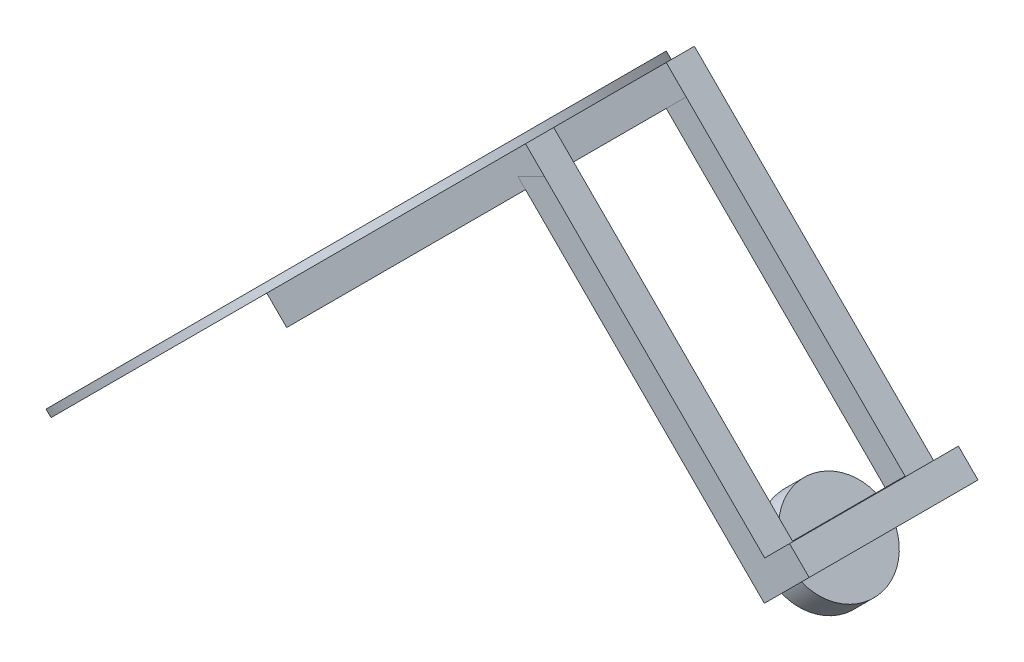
ISO-10303-21;
HEADER;
FILE_DESCRIPTION(('STEP AP214'),'2;1');
FILE_NAME('part.step','',(''),(''),'','','');
FILE_SCHEMA(('AUTOMOTIVE_DESIGN { 1 0 10303 214 1 1 1 1 }'));
ENDSEC;
DATA;
#1=APPLICATION_CONTEXT('core data for automotive mechanical design processes');
#2=APPLICATION_PROTOCOL_DEFINITION('international standard','automotive_design',2000,#1);
#3=PRODUCT_CONTEXT('',#1,'mechanical');
#4=PRODUCT('Part','Part','',(#3));
#5=PRODUCT_RELATED_PRODUCT_CATEGORY('part','',(#4));
#6=PRODUCT_DEFINITION_FORMATION('','',#4);
#7=PRODUCT_DEFINITION_CONTEXT('part definition',#1,'design');
#8=PRODUCT_DEFINITION('design','',#6,#7);
#9=PRODUCT_DEFINITION_SHAPE('','',#8);
#10=(LENGTH_UNIT() NAMED_UNIT(*) SI_UNIT(.MILLI.,.METRE.));
#11=(NAMED_UNIT(*) PLANE_ANGLE_UNIT() SI_UNIT($,.RADIAN.));
#12=(NAMED_UNIT(*) SI_UNIT($,.STERADIAN.) SOLID_ANGLE_UNIT());
#13=UNCERTAINTY_MEASURE_WITH_UNIT(LENGTH_MEASURE(1.E-05),#10,'distance_accuracy_value','');
#14=(GEOMETRIC_REPRESENTATION_CONTEXT(3) GLOBAL_UNCERTAINTY_ASSIGNED_CONTEXT((#13)) GLOBAL_UNIT_ASSIGNED_CONTEXT((#10,
#11,#12)) REPRESENTATION_CONTEXT('',''));
#15=CARTESIAN_POINT('',(0.,0.,0.));
#16=DIRECTION('',(0.,0.,1.));
#17=DIRECTION('',(1.,0.,0.));
#18=AXIS2_PLACEMENT_3D('',#15,#16,#17);
#19=CARTESIAN_POINT('',(228.226146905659,-233.486659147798,12.7));
#20=DIRECTION('',(0.707106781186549,0.707106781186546,0.));
#21=DIRECTION('',(0.,0.,1.));
#22=AXIS2_PLACEMENT_3D('',#19,#20,#21);
#23=PLANE('',#22);
#24=CARTESIAN_POINT('',(219.381229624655,-224.641741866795,-63.5));
#25=DIRECTION('',(-0.707106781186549,-0.707106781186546,0.));
#26=DIRECTION('',(0.,0.,-1.));
#27=AXIS2_PLACEMENT_3D('',#24,#25,#26);
#28=CIRCLE('',#27,44.45);
#29=CARTESIAN_POINT('',(228.226146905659,-233.486659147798,-20.8463087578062));
#30=VERTEX_POINT('',#29);
#31=CARTESIAN_POINT('',(210.265634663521,-215.52614690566,-20.9604377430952));
#32=VERTEX_POINT('',#31);
#33=EDGE_CURVE('E12',#30,#32,#28,.T.);
#34=ORIENTED_EDGE('',*,*,#33,.F.);
#35=DIRECTION('',(0.,0.,-1.));
#36=VECTOR('',#35,1.);
#37=CARTESIAN_POINT('',(228.226146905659,-233.486659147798,12.7));
#38=LINE('',#37,#36);
#39=CARTESIAN_POINT('',(228.226146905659,-233.486659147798,12.7));
#40=VERTEX_POINT('',#39);
#41=EDGE_CURVE('E142',#40,#30,#38,.T.);
#42=ORIENTED_EDGE('',*,*,#41,.F.);
#43=DIRECTION('',(-0.707106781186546,0.707106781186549,0.));
#44=VECTOR('',#43,1.);
#45=CARTESIAN_POINT('',(228.226146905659,-233.486659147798,12.7));
#46=LINE('',#45,#44);
#47=CARTESIAN_POINT('',(-5.26051224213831,0.,12.7));
#48=VERTEX_POINT('',#47);
#49=EDGE_CURVE('E228',#40,#48,#46,.T.);
#50=ORIENTED_EDGE('',*,*,#49,.T.);
#51=DIRECTION('',(0.,0.,-1.));
#52=VECTOR('',#51,1.);
#53=CARTESIAN_POINT('',(-5.26051224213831,0.,12.7));
#54=LINE('',#53,#52);
#55=CARTESIAN_POINT('',(-5.26051224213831,0.,-12.7));
#56=VERTEX_POINT('',#55);
#57=EDGE_CURVE('E215',#48,#56,#54,.T.);
#58=ORIENTED_EDGE('',*,*,#57,.T.);
#59=DIRECTION('',(-0.707106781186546,0.707106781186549,0.));
#60=VECTOR('',#59,1.);
#61=CARTESIAN_POINT('',(228.226146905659,-233.486659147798,-12.7));
#62=LINE('',#61,#60);
#63=CARTESIAN_POINT('',(210.265634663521,-215.52614690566,-12.7));
#64=VERTEX_POINT('',#63);
#65=EDGE_CURVE('E217',#64,#56,#62,.T.);
#66=ORIENTED_EDGE('',*,*,#65,.F.);
#67=DIRECTION('',(0.,0.,-1.));
#68=VECTOR('',#67,1.);
#69=CARTESIAN_POINT('',(210.265634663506,-215.526146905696,500000.));
#70=LINE('',#69,#68);
#71=EDGE_CURVE('E205',#64,#32,#70,.T.);
#72=ORIENTED_EDGE('',*,*,#71,.T.);
#73=EDGE_LOOP('',(#34,#42,#50,#58,#66,#72));
#74=FACE_BOUND('',#73,.T.);
#75=ADVANCED_FACE('F47',(#74),#23,.F.);
#76=CARTESIAN_POINT('',(246.186659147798,-215.52614690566,12.7));
#77=DIRECTION('',(-0.707106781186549,-0.707106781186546,0.));
#78=DIRECTION('',(0.,0.,-1.));
#79=AXIS2_PLACEMENT_3D('',#76,#77,#78);
#80=PLANE('',#79);
#81=DIRECTION('',(0.,0.,1.));
#82=VECTOR('',#81,1.);
#83=CARTESIAN_POINT('',(228.530815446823,-197.870303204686,12.7));
#84=LINE('',#83,#82);
#85=CARTESIAN_POINT('',(228.530815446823,-197.870303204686,-139.7));
#86=VERTEX_POINT('',#85);
#87=CARTESIAN_POINT('',(228.530815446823,-197.870303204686,12.7));
#88=VERTEX_POINT('',#87);
#89=EDGE_CURVE('E160',#86,#88,#84,.T.);
#90=ORIENTED_EDGE('',*,*,#89,.F.);
#91=DIRECTION('',(-0.707106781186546,0.707106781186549,0.));
#92=VECTOR('',#91,1.);
#93=CARTESIAN_POINT('',(246.186659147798,-215.52614690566,-139.7));
#94=LINE('',#93,#92);
#95=CARTESIAN_POINT('',(12.7,17.9605122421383,-139.7));
#96=VERTEX_POINT('',#95);
#97=EDGE_CURVE('E199',#86,#96,#94,.T.);
#98=ORIENTED_EDGE('',*,*,#97,.T.);
#99=DIRECTION('',(0.,0.,1.));
#100=VECTOR('',#99,1.);
#101=CARTESIAN_POINT('',(12.7,17.9605122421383,-114.3));
#102=LINE('',#101,#100);
#103=CARTESIAN_POINT('',(12.7,17.9605122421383,-114.3));
#104=VERTEX_POINT('',#103);
#105=EDGE_CURVE('E187',#96,#104,#102,.T.);
#106=ORIENTED_EDGE('',*,*,#105,.T.);
#107=DIRECTION('',(-0.707106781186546,0.707106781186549,0.));
#108=VECTOR('',#107,1.);
#109=CARTESIAN_POINT('',(246.186659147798,-215.52614690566,-114.3));
#110=LINE('',#109,#108);
#111=CARTESIAN_POINT('',(228.226146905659,-197.565634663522,-114.3));
#112=VERTEX_POINT('',#111);
#113=EDGE_CURVE('E197',#112,#104,#110,.T.);
#114=ORIENTED_EDGE('',*,*,#113,.F.);
#115=DIRECTION('',(0.,0.,-1.));
#116=VECTOR('',#115,1.);
#117=CARTESIAN_POINT('',(228.226146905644,-197.565634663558,500000.));
#118=LINE('',#117,#116);
#119=CARTESIAN_POINT('',(228.226146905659,-197.565634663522,-12.6999999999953));
#120=VERTEX_POINT('',#119);
#121=EDGE_CURVE('E207',#120,#112,#118,.T.);
#122=ORIENTED_EDGE('',*,*,#121,.F.);
#123=DIRECTION('',(-0.707106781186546,0.707106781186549,0.));
#124=VECTOR('',#123,1.);
#125=CARTESIAN_POINT('',(246.186659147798,-215.52614690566,-12.7));
#126=LINE('',#125,#124);
#127=CARTESIAN_POINT('',(12.7,17.9605122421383,-12.7));
#128=VERTEX_POINT('',#127);
#129=EDGE_CURVE('E51',#120,#128,#126,.T.);
#130=ORIENTED_EDGE('',*,*,#129,.T.);
#131=DIRECTION('',(0.,0.,1.));
#132=VECTOR('',#131,1.);
#133=CARTESIAN_POINT('',(12.7,17.9605122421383,12.7));
#134=LINE('',#133,#132);
#135=CARTESIAN_POINT('',(12.7,17.9605122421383,12.7));
#136=VERTEX_POINT('',#135);
#137=EDGE_CURVE('E220',#128,#136,#134,.T.);
#138=ORIENTED_EDGE('',*,*,#137,.T.);
#139=DIRECTION('',(-0.707106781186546,0.707106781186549,0.));
#140=VECTOR('',#139,1.);
#141=CARTESIAN_POINT('',(246.186659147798,-215.52614690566,12.7));
#142=LINE('',#141,#140);
#143=EDGE_CURVE('E230',#88,#136,#142,.T.);
#144=ORIENTED_EDGE('',*,*,#143,.F.);
#145=EDGE_LOOP('',(#90,#98,#106,#114,#122,#130,#138,#144));
#146=FACE_BOUND('',#145,.T.);
#147=ADVANCED_FACE('F236',(#146),#80,.F.);
#148=CARTESIAN_POINT('',(228.226146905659,-233.486659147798,-12.7));
#149=DIRECTION('',(0.,0.,1.));
#150=DIRECTION('',(0.707106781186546,-0.707106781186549,0.));
#151=AXIS2_PLACEMENT_3D('',#148,#149,#150);
#152=PLANE('',#151);
#153=ORIENTED_EDGE('',*,*,#129,.F.);
#154=DIRECTION('',(-0.707106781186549,-0.707106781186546,0.));
#155=VECTOR('',#154,1.);
#156=CARTESIAN_POINT('',(210.265634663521,-215.52614690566,-12.6999999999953));
#157=LINE('',#156,#155);
#158=EDGE_CURVE('E211',#120,#64,#157,.T.);
#159=ORIENTED_EDGE('',*,*,#158,.T.);
#160=ORIENTED_EDGE('',*,*,#65,.T.);
#161=DIRECTION('',(0.707106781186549,0.707106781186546,0.));
#162=VECTOR('',#161,1.);
#163=CARTESIAN_POINT('',(-5.26051224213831,0.,-12.7));
#164=LINE('',#163,#162);
#165=EDGE_CURVE('E214',#56,#128,#164,.T.);
#166=ORIENTED_EDGE('',*,*,#165,.T.);
#167=EDGE_LOOP('',(#153,#159,#160,#166));
#168=FACE_BOUND('',#167,.T.);
#169=ADVANCED_FACE('F49',(#168),#152,.F.);
#170=CARTESIAN_POINT('',(228.226146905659,-233.486659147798,12.7));
#171=DIRECTION('',(0.,0.,-1.));
#172=DIRECTION('',(-0.707106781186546,0.707106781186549,0.));
#173=AXIS2_PLACEMENT_3D('',#170,#171,#172);
#174=PLANE('',#173);
#175=DIRECTION('',(-0.707106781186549,-0.707106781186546,0.));
#176=VECTOR('',#175,1.);
#177=CARTESIAN_POINT('',(-5.26051224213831,0.,12.7));
#178=LINE('',#177,#176);
#179=EDGE_CURVE('E223',#136,#48,#178,.T.);
#180=ORIENTED_EDGE('',*,*,#179,.T.);
#181=ORIENTED_EDGE('',*,*,#49,.F.);
#182=DIRECTION('',(-0.707106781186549,-0.707106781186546,0.));
#183=VECTOR('',#182,1.);
#184=CARTESIAN_POINT('',(228.226146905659,-233.486659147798,12.7));
#185=LINE('',#184,#183);
#186=CARTESIAN_POINT('',(268.637299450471,-193.075506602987,12.7));
#187=VERTEX_POINT('',#186);
#188=EDGE_CURVE('E151',#187,#40,#185,.T.);
#189=ORIENTED_EDGE('',*,*,#188,.F.);
#190=DIRECTION('',(0.707106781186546,-0.707106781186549,0.));
#191=VECTOR('',#190,1.);
#192=CARTESIAN_POINT('',(268.637299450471,-193.075506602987,12.7));
#193=LINE('',#192,#191);
#194=CARTESIAN_POINT('',(250.981455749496,-175.419662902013,12.7));
#195=VERTEX_POINT('',#194);
#196=EDGE_CURVE('E170',#195,#187,#193,.T.);
#197=ORIENTED_EDGE('',*,*,#196,.F.);
#198=DIRECTION('',(-0.707106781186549,-0.707106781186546,0.));
#199=VECTOR('',#198,1.);
#200=CARTESIAN_POINT('',(250.981455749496,-175.419662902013,12.7));
#201=LINE('',#200,#199);
#202=EDGE_CURVE('E173',#195,#88,#201,.T.);
#203=ORIENTED_EDGE('',*,*,#202,.T.);
#204=ORIENTED_EDGE('',*,*,#143,.T.);
#205=EDGE_LOOP('',(#180,#181,#189,#197,#203,#204));
#206=FACE_BOUND('',#205,.T.);
#207=ADVANCED_FACE('F246',(#206),#174,.F.);
#208=CARTESIAN_POINT('',(210.265634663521,-215.52614690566,-106.039562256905));
#209=VERTEX_POINT('',#208);
#210=CARTESIAN_POINT('',(228.226146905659,-233.486659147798,-106.153691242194));
#211=VERTEX_POINT('',#210);
#212=EDGE_CURVE('E56',#209,#211,#28,.T.);
#213=ORIENTED_EDGE('',*,*,#212,.F.);
#214=CARTESIAN_POINT('',(210.265634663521,-215.52614690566,-114.3));
#215=VERTEX_POINT('',#214);
#216=EDGE_CURVE('E204',#209,#215,#70,.T.);
#217=ORIENTED_EDGE('',*,*,#216,.T.);
#218=DIRECTION('',(-0.707106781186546,0.707106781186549,0.));
#219=VECTOR('',#218,1.);
#220=CARTESIAN_POINT('',(228.226146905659,-233.486659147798,-114.3));
#221=LINE('',#220,#219);
#222=CARTESIAN_POINT('',(-5.26051224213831,0.,-114.3));
#223=VERTEX_POINT('',#222);
#224=EDGE_CURVE('E195',#215,#223,#221,.T.);
#225=ORIENTED_EDGE('',*,*,#224,.T.);
#226=DIRECTION('',(0.,0.,-1.));
#227=VECTOR('',#226,1.);
#228=CARTESIAN_POINT('',(-5.26051224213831,0.,-114.3));
#229=LINE('',#228,#227);
#230=CARTESIAN_POINT('',(-5.26051224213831,0.,-139.7));
#231=VERTEX_POINT('',#230);
#232=EDGE_CURVE('E184',#223,#231,#229,.T.);
#233=ORIENTED_EDGE('',*,*,#232,.T.);
#234=DIRECTION('',(-0.707106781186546,0.707106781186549,0.));
#235=VECTOR('',#234,1.);
#236=CARTESIAN_POINT('',(228.226146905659,-233.486659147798,-139.7));
#237=LINE('',#236,#235);
#238=CARTESIAN_POINT('',(228.226146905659,-233.486659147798,-139.7));
#239=VERTEX_POINT('',#238);
#240=EDGE_CURVE('E149',#239,#231,#237,.T.);
#241=ORIENTED_EDGE('',*,*,#240,.F.);
#242=EDGE_CURVE('E140',#211,#239,#38,.T.);
#243=ORIENTED_EDGE('',*,*,#242,.F.);
#244=EDGE_LOOP('',(#213,#217,#225,#233,#241,#243));
#245=FACE_BOUND('',#244,.T.);
#246=ADVANCED_FACE('F147',(#245),#23,.F.);
#247=CARTESIAN_POINT('',(237.206403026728,-224.506403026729,0.));
#248=DIRECTION('',(-0.707106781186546,0.707106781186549,0.));
#249=DIRECTION('',(0.,0.,1.));
#250=AXIS2_PLACEMENT_3D('',#247,#248,#249);
#251=PLANE('',#250);
#252=ORIENTED_EDGE('',*,*,#41,.T.);
#253=EDGE_CURVE('E138',#30,#211,#38,.T.);
#254=ORIENTED_EDGE('',*,*,#253,.T.);
#255=ORIENTED_EDGE('',*,*,#242,.T.);
#256=DIRECTION('',(0.707106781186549,0.707106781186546,0.));
#257=VECTOR('',#256,1.);
#258=CARTESIAN_POINT('',(228.226146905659,-233.486659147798,-139.7));
#259=LINE('',#258,#257);
#260=CARTESIAN_POINT('',(268.637299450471,-193.075506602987,-139.7));
#261=VERTEX_POINT('',#260);
#262=EDGE_CURVE('E182',#239,#261,#259,.T.);
#263=ORIENTED_EDGE('',*,*,#262,.T.);
#264=DIRECTION('',(0.,0.,-1.));
#265=VECTOR('',#264,1.);
#266=CARTESIAN_POINT('',(268.637299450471,-193.075506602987,12.7));
#267=LINE('',#266,#265);
#268=EDGE_CURVE('E163',#187,#261,#267,.T.);
#269=ORIENTED_EDGE('',*,*,#268,.F.);
#270=ORIENTED_EDGE('',*,*,#188,.T.);
#271=EDGE_LOOP('',(#252,#254,#255,#263,#269,#270));
#272=FACE_BOUND('',#271,.T.);
#273=ADVANCED_FACE('F139',(#272),#251,.F.);
#274=CARTESIAN_POINT('',(3.71974387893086,8.98025612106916,0.));
#275=DIRECTION('',(-0.707106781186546,0.707106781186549,0.));
#276=DIRECTION('',(0.,0.,1.));
#277=AXIS2_PLACEMENT_3D('',#274,#275,#276);
#278=PLANE('',#277);
#279=ORIENTED_EDGE('',*,*,#165,.F.);
#280=ORIENTED_EDGE('',*,*,#57,.F.);
#281=ORIENTED_EDGE('',*,*,#179,.F.);
#282=ORIENTED_EDGE('',*,*,#137,.F.);
#283=EDGE_LOOP('',(#279,#280,#281,#282));
#284=FACE_BOUND('',#283,.T.);
#285=ADVANCED_FACE('F242',(#284),#278,.T.);
#286=CARTESIAN_POINT('',(210.265634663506,-215.526146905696,500000.));
#287=DIRECTION('',(0.707106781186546,-0.707106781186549,0.));
#288=DIRECTION('',(0.,0.,-1.));
#289=AXIS2_PLACEMENT_3D('',#286,#287,#288);
#290=PLANE('',#289);
#291=ORIENTED_EDGE('',*,*,#158,.F.);
#292=ORIENTED_EDGE('',*,*,#121,.T.);
#293=DIRECTION('',(-0.707106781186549,-0.707106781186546,0.));
#294=VECTOR('',#293,1.);
#295=CARTESIAN_POINT('',(210.265634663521,-215.52614690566,-114.3));
#296=LINE('',#295,#294);
#297=EDGE_CURVE('E201',#112,#215,#296,.T.);
#298=ORIENTED_EDGE('',*,*,#297,.T.);
#299=ORIENTED_EDGE('',*,*,#216,.F.);
#300=EDGE_CURVE('E208',#32,#209,#70,.T.);
#301=ORIENTED_EDGE('',*,*,#300,.F.);
#302=ORIENTED_EDGE('',*,*,#71,.F.);
#303=EDGE_LOOP('',(#291,#292,#298,#299,#301,#302));
#304=FACE_BOUND('',#303,.T.);
#305=ADVANCED_FACE('F270',(#304),#290,.F.);
#306=CARTESIAN_POINT('',(228.226146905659,-233.486659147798,-139.7));
#307=DIRECTION('',(0.,0.,1.));
#308=DIRECTION('',(0.707106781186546,-0.707106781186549,0.));
#309=AXIS2_PLACEMENT_3D('',#306,#307,#308);
#310=PLANE('',#309);
#311=DIRECTION('',(0.707106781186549,0.707106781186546,0.));
#312=VECTOR('',#311,1.);
#313=CARTESIAN_POINT('',(-5.26051224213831,0.,-139.7));
#314=LINE('',#313,#312);
#315=EDGE_CURVE('E181',#231,#96,#314,.T.);
#316=ORIENTED_EDGE('',*,*,#315,.T.);
#317=ORIENTED_EDGE('',*,*,#97,.F.);
#318=DIRECTION('',(-0.707106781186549,-0.707106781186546,0.));
#319=VECTOR('',#318,1.);
#320=CARTESIAN_POINT('',(250.981455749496,-175.419662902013,-139.7));
#321=LINE('',#320,#319);
#322=CARTESIAN_POINT('',(250.981455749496,-175.419662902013,-139.7));
#323=VERTEX_POINT('',#322);
#324=EDGE_CURVE('E178',#323,#86,#321,.T.);
#325=ORIENTED_EDGE('',*,*,#324,.F.);
#326=DIRECTION('',(-0.707106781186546,0.707106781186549,0.));
#327=VECTOR('',#326,1.);
#328=CARTESIAN_POINT('',(268.637299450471,-193.075506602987,-139.7));
#329=LINE('',#328,#327);
#330=EDGE_CURVE('E166',#261,#323,#329,.T.);
#331=ORIENTED_EDGE('',*,*,#330,.F.);
#332=ORIENTED_EDGE('',*,*,#262,.F.);
#333=ORIENTED_EDGE('',*,*,#240,.T.);
#334=EDGE_LOOP('',(#316,#317,#325,#331,#332,#333));
#335=FACE_BOUND('',#334,.T.);
#336=ADVANCED_FACE('F256',(#335),#310,.F.);
#337=CARTESIAN_POINT('',(228.226146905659,-233.486659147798,-114.3));
#338=DIRECTION('',(0.,0.,-1.));
#339=DIRECTION('',(-0.707106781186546,0.707106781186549,0.));
#340=AXIS2_PLACEMENT_3D('',#337,#338,#339);
#341=PLANE('',#340);
#342=ORIENTED_EDGE('',*,*,#297,.F.);
#343=ORIENTED_EDGE('',*,*,#113,.T.);
#344=DIRECTION('',(-0.707106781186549,-0.707106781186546,0.));
#345=VECTOR('',#344,1.);
#346=CARTESIAN_POINT('',(-5.26051224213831,0.,-114.3));
#347=LINE('',#346,#345);
#348=EDGE_CURVE('E190',#104,#223,#347,.T.);
#349=ORIENTED_EDGE('',*,*,#348,.T.);
#350=ORIENTED_EDGE('',*,*,#224,.F.);
#351=EDGE_LOOP('',(#342,#343,#349,#350));
#352=FACE_BOUND('',#351,.T.);
#353=ADVANCED_FACE('F268',(#352),#341,.F.);
#354=CARTESIAN_POINT('',(3.71974387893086,8.98025612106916,0.));
#355=DIRECTION('',(-0.707106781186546,0.707106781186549,0.));
#356=DIRECTION('',(0.,0.,1.));
#357=AXIS2_PLACEMENT_3D('',#354,#355,#356);
#358=PLANE('',#357);
#359=ORIENTED_EDGE('',*,*,#315,.F.);
#360=ORIENTED_EDGE('',*,*,#232,.F.);
#361=ORIENTED_EDGE('',*,*,#348,.F.);
#362=ORIENTED_EDGE('',*,*,#105,.F.);
#363=EDGE_LOOP('',(#359,#360,#361,#362));
#364=FACE_BOUND('',#363,.T.);
#365=ADVANCED_FACE('F264',(#364),#358,.T.);
#366=CARTESIAN_POINT('',(250.981455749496,-175.419662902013,12.7));
#367=DIRECTION('',(0.707106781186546,-0.707106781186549,0.));
#368=DIRECTION('',(0.,0.,-1.));
#369=AXIS2_PLACEMENT_3D('',#366,#367,#368);
#370=PLANE('',#369);
#371=ORIENTED_EDGE('',*,*,#89,.T.);
#372=ORIENTED_EDGE('',*,*,#202,.F.);
#373=DIRECTION('',(0.,0.,1.));
#374=VECTOR('',#373,1.);
#375=CARTESIAN_POINT('',(250.981455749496,-175.419662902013,12.7));
#376=LINE('',#375,#374);
#377=EDGE_CURVE('E168',#323,#195,#376,.T.);
#378=ORIENTED_EDGE('',*,*,#377,.F.);
#379=ORIENTED_EDGE('',*,*,#324,.T.);
#380=EDGE_LOOP('',(#371,#372,#378,#379));
#381=FACE_BOUND('',#380,.T.);
#382=ADVANCED_FACE('F259',(#381),#370,.F.);
#383=CARTESIAN_POINT('',(35.1506403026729,40.4111525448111,0.));
#384=DIRECTION('',(0.707106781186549,0.707106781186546,0.));
#385=DIRECTION('',(0.,0.,1.));
#386=AXIS2_PLACEMENT_3D('',#383,#384,#385);
#387=PLANE('',#386);
#388=ORIENTED_EDGE('',*,*,#268,.T.);
#389=ORIENTED_EDGE('',*,*,#330,.T.);
#390=ORIENTED_EDGE('',*,*,#377,.T.);
#391=ORIENTED_EDGE('',*,*,#196,.T.);
#392=EDGE_LOOP('',(#388,#389,#390,#391));
#393=FACE_BOUND('',#392,.T.);
#394=ADVANCED_FACE('F250',(#393),#387,.T.);
#395=CARTESIAN_POINT('',(219.381229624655,-224.641741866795,-63.5));
#396=DIRECTION('',(-0.707106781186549,-0.707106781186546,0.));
#397=DIRECTION('',(0.,0.,-1.));
#398=AXIS2_PLACEMENT_3D('',#395,#396,#397);
#399=PLANE('',#398);
#400=EDGE_CURVE('E58',#32,#209,#28,.T.);
#401=ORIENTED_EDGE('',*,*,#400,.F.);
#402=ORIENTED_EDGE('',*,*,#300,.T.);
#403=EDGE_LOOP('',(#401,#402));
#404=FACE_BOUND('',#403,.T.);
#405=ADVANCED_FACE('F273',(#404),#399,.F.);
#406=CARTESIAN_POINT('',(201.420717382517,-242.602254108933,-63.5));
#407=DIRECTION('',(0.707106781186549,0.707106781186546,0.));
#408=DIRECTION('',(0.,0.,1.));
#409=AXIS2_PLACEMENT_3D('',#406,#407,#408);
#410=CYLINDRICAL_SURFACE('',#409,44.45);
#411=CARTESIAN_POINT('',(201.420717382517,-242.602254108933,-63.5));
#412=DIRECTION('',(-0.707106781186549,-0.707106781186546,0.));
#413=DIRECTION('',(0.,0.,-1.));
#414=AXIS2_PLACEMENT_3D('',#411,#412,#413);
#415=CIRCLE('',#414,44.45);
#416=CARTESIAN_POINT('',(201.420717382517,-242.602254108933,-107.95));
#417=VERTEX_POINT('',#416);
#418=EDGE_CURVE('E158',#417,#417,#415,.T.);
#419=ORIENTED_EDGE('',*,*,#418,.F.);
#420=EDGE_LOOP('',(#419));
#421=FACE_BOUND('',#420,.T.);
#422=EDGE_CURVE('E155',#211,#30,#28,.T.);
#423=ORIENTED_EDGE('',*,*,#422,.T.);
#424=ORIENTED_EDGE('',*,*,#33,.T.);
#425=ORIENTED_EDGE('',*,*,#400,.T.);
#426=ORIENTED_EDGE('',*,*,#212,.T.);
#427=EDGE_LOOP('',(#423,#424,#425,#426));
#428=FACE_BOUND('',#427,.T.);
#429=ADVANCED_FACE('F154',(#421,#428),#410,.T.);
#430=CARTESIAN_POINT('',(201.420717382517,-242.602254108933,-63.5));
#431=DIRECTION('',(-0.707106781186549,-0.707106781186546,0.));
#432=DIRECTION('',(0.,0.,-1.));
#433=AXIS2_PLACEMENT_3D('',#430,#431,#432);
#434=PLANE('',#433);
#435=ORIENTED_EDGE('',*,*,#418,.T.);
#436=EDGE_LOOP('',(#435));
#437=FACE_BOUND('',#436,.T.);
#438=ADVANCED_FACE('F280',(#437),#434,.T.);
#439=ORIENTED_EDGE('',*,*,#253,.F.);
#440=ORIENTED_EDGE('',*,*,#422,.F.);
#441=EDGE_LOOP('',(#439,#440));
#442=FACE_BOUND('',#441,.T.);
#443=ADVANCED_FACE('F157',(#442),#399,.F.);
#444=CLOSED_SHELL('',(#75,#147,#169,#207,#246,#273,#285,#305,#336,#353,#365,#382,#394,#405,#429,
#438,#443));
#445=MANIFOLD_SOLID_BREP('B2',#444);
#446=CARTESIAN_POINT('',(-220.786659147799,-215.526146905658,12.6999999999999));
#447=DIRECTION('',(0.707106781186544,-0.707106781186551,0.));
#448=DIRECTION('',(0.,0.,1.));
#449=AXIS2_PLACEMENT_3D('',#446,#447,#448);
#450=PLANE('',#449);
#451=CARTESIAN_POINT('',(-211.80640302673,-206.545890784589,-63.5000000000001));
#452=DIRECTION('',(-0.707106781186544,0.707106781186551,0.));
#453=DIRECTION('',(-0.707106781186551,-0.707106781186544,0.));
#454=AXIS2_PLACEMENT_3D('',#451,#452,#453);
#455=CIRCLE('',#454,228.6);
#456=CARTESIAN_POINT('',(-59.4064030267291,-54.1458907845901,12.7));
#457=VERTEX_POINT('',#456);
#458=CARTESIAN_POINT('',(-54.2035477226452,-48.9430354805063,-12.7));
#459=VERTEX_POINT('',#458);
#460=EDGE_CURVE('E456',#457,#459,#455,.T.);
#461=ORIENTED_EDGE('',*,*,#460,.F.);
#462=DIRECTION('',(0.707106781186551,0.707106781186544,0.));
#463=VECTOR('',#462,1.);
#464=CARTESIAN_POINT('',(-220.786659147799,-215.526146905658,12.6999999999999));
#465=LINE('',#464,#463);
#466=CARTESIAN_POINT('',(12.7000000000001,17.9605122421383,12.7));
#467=VERTEX_POINT('',#466);
#468=EDGE_CURVE('E607',#457,#467,#465,.T.);
#469=ORIENTED_EDGE('',*,*,#468,.T.);
#470=DIRECTION('',(0.,0.,-1.));
#471=VECTOR('',#470,1.);
#472=CARTESIAN_POINT('',(12.7000000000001,17.9605122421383,12.7));
#473=LINE('',#472,#471);
#474=CARTESIAN_POINT('',(12.7000000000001,17.9605122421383,-12.7));
#475=VERTEX_POINT('',#474);
#476=EDGE_CURVE('E590',#467,#475,#473,.T.);
#477=ORIENTED_EDGE('',*,*,#476,.T.);
#478=DIRECTION('',(0.707106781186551,0.707106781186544,0.));
#479=VECTOR('',#478,1.);
#480=CARTESIAN_POINT('',(-220.786659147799,-215.526146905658,-12.7000000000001));
#481=LINE('',#480,#479);
#482=EDGE_CURVE('E594',#459,#475,#481,.T.);
#483=ORIENTED_EDGE('',*,*,#482,.F.);
#484=EDGE_LOOP('',(#461,#469,#477,#483));
#485=FACE_BOUND('',#484,.T.);
#486=ADVANCED_FACE('F446',(#485),#450,.F.);
#487=CARTESIAN_POINT('',(-220.786659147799,-215.526146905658,-12.7000000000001));
#488=DIRECTION('',(0.,0.,1.));
#489=DIRECTION('',(-0.707106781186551,-0.707106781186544,0.));
#490=AXIS2_PLACEMENT_3D('',#487,#488,#489);
#491=PLANE('',#490);
#492=DIRECTION('',(0.707106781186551,0.707106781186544,0.));
#493=VECTOR('',#492,1.);
#494=CARTESIAN_POINT('',(-202.826146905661,-233.486659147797,-12.7000000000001));
#495=LINE('',#494,#493);
#496=CARTESIAN_POINT('',(-184.865634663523,-215.526146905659,-12.6999999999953));
#497=VERTEX_POINT('',#496);
#498=CARTESIAN_POINT('',(30.6605122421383,-1.00613961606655E-13,-12.7));
#499=VERTEX_POINT('',#498);
#500=EDGE_CURVE('E450',#497,#499,#495,.T.);
#501=ORIENTED_EDGE('',*,*,#500,.F.);
#502=DIRECTION('',(-0.707106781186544,0.707106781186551,0.));
#503=VECTOR('',#502,1.);
#504=CARTESIAN_POINT('',(-202.826146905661,-197.56563466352,-12.6999999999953));
#505=LINE('',#504,#503);
#506=CARTESIAN_POINT('',(-202.826146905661,-197.56563466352,-12.7000000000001));
#507=VERTEX_POINT('',#506);
#508=EDGE_CURVE('E583',#497,#507,#505,.T.);
#509=ORIENTED_EDGE('',*,*,#508,.T.);
#510=EDGE_CURVE('E604',#507,#459,#481,.T.);
#511=ORIENTED_EDGE('',*,*,#510,.T.);
#512=ORIENTED_EDGE('',*,*,#482,.T.);
#513=DIRECTION('',(0.707106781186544,-0.707106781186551,0.));
#514=VECTOR('',#513,1.);
#515=CARTESIAN_POINT('',(12.7000000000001,17.9605122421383,-12.7));
#516=LINE('',#515,#514);
#517=EDGE_CURVE('E586',#475,#499,#516,.T.);
#518=ORIENTED_EDGE('',*,*,#517,.T.);
#519=EDGE_LOOP('',(#501,#509,#511,#512,#518));
#520=FACE_BOUND('',#519,.T.);
#521=ADVANCED_FACE('F448',(#520),#491,.F.);
#522=CARTESIAN_POINT('',(-202.826146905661,-233.486659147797,12.6999999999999));
#523=DIRECTION('',(-0.707106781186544,0.707106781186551,0.));
#524=DIRECTION('',(0.,0.,-1.));
#525=AXIS2_PLACEMENT_3D('',#522,#523,#524);
#526=PLANE('',#525);
#527=DIRECTION('',(0.,0.,1.));
#528=VECTOR('',#527,1.);
#529=CARTESIAN_POINT('',(30.6605122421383,-1.02348685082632E-13,12.7));
#530=LINE('',#529,#528);
#531=CARTESIAN_POINT('',(30.6605122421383,-1.02348685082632E-13,12.7));
#532=VERTEX_POINT('',#531);
#533=EDGE_CURVE('E597',#499,#532,#530,.T.);
#534=ORIENTED_EDGE('',*,*,#533,.T.);
#535=DIRECTION('',(0.707106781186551,0.707106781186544,0.));
#536=VECTOR('',#535,1.);
#537=CARTESIAN_POINT('',(-202.826146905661,-233.486659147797,12.6999999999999));
#538=LINE('',#537,#536);
#539=CARTESIAN_POINT('',(-202.826146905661,-233.486659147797,12.6999999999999));
#540=VERTEX_POINT('',#539);
#541=EDGE_CURVE('E608',#540,#532,#538,.T.);
#542=ORIENTED_EDGE('',*,*,#541,.F.);
#543=DIRECTION('',(0.,0.,1.));
#544=VECTOR('',#543,1.);
#545=CARTESIAN_POINT('',(-202.826146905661,-233.486659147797,12.6999999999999));
#546=LINE('',#545,#544);
#547=CARTESIAN_POINT('',(-202.826146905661,-233.486659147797,-139.7));
#548=VERTEX_POINT('',#547);
#549=EDGE_CURVE('E587',#548,#540,#546,.T.);
#550=ORIENTED_EDGE('',*,*,#549,.F.);
#551=DIRECTION('',(0.707106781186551,0.707106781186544,0.));
#552=VECTOR('',#551,1.);
#553=CARTESIAN_POINT('',(-202.826146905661,-233.486659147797,-139.7));
#554=LINE('',#553,#552);
#555=CARTESIAN_POINT('',(30.6605122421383,0.,-139.7));
#556=VERTEX_POINT('',#555);
#557=EDGE_CURVE('E571',#548,#556,#554,.T.);
#558=ORIENTED_EDGE('',*,*,#557,.T.);
#559=DIRECTION('',(0.,0.,1.));
#560=VECTOR('',#559,1.);
#561=CARTESIAN_POINT('',(30.6605122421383,0.,-114.3));
#562=LINE('',#561,#560);
#563=CARTESIAN_POINT('',(30.6605122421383,0.,-114.3));
#564=VERTEX_POINT('',#563);
#565=EDGE_CURVE('E560',#556,#564,#562,.T.);
#566=ORIENTED_EDGE('',*,*,#565,.T.);
#567=DIRECTION('',(0.707106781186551,0.707106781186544,0.));
#568=VECTOR('',#567,1.);
#569=CARTESIAN_POINT('',(-202.826146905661,-233.486659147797,-114.3));
#570=LINE('',#569,#568);
#571=CARTESIAN_POINT('',(-184.865634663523,-215.526146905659,-114.3));
#572=VERTEX_POINT('',#571);
#573=EDGE_CURVE('E569',#572,#564,#570,.T.);
#574=ORIENTED_EDGE('',*,*,#573,.F.);
#575=DIRECTION('',(0.,0.,-1.));
#576=VECTOR('',#575,1.);
#577=CARTESIAN_POINT('',(-184.86563466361,-215.526146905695,500000.));
#578=LINE('',#577,#576);
#579=EDGE_CURVE('E580',#497,#572,#578,.T.);
#580=ORIENTED_EDGE('',*,*,#579,.F.);
#581=ORIENTED_EDGE('',*,*,#500,.T.);
#582=EDGE_LOOP('',(#534,#542,#550,#558,#566,#574,#580,#581));
#583=FACE_BOUND('',#582,.T.);
#584=ADVANCED_FACE('F618',(#583),#526,.F.);
#585=CARTESIAN_POINT('',(-220.786659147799,-215.526146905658,12.6999999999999));
#586=DIRECTION('',(0.,0.,-1.));
#587=DIRECTION('',(0.707106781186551,0.707106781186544,0.));
#588=AXIS2_PLACEMENT_3D('',#585,#586,#587);
#589=PLANE('',#588);
#590=DIRECTION('',(-0.707106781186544,0.707106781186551,0.));
#591=VECTOR('',#590,1.);
#592=CARTESIAN_POINT('',(12.7000000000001,17.9605122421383,12.7));
#593=LINE('',#592,#591);
#594=EDGE_CURVE('E599',#532,#467,#593,.T.);
#595=ORIENTED_EDGE('',*,*,#594,.T.);
#596=ORIENTED_EDGE('',*,*,#468,.F.);
#597=CARTESIAN_POINT('',(-220.786659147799,-215.526146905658,12.6999999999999));
#598=VERTEX_POINT('',#597);
#599=EDGE_CURVE('E546',#598,#457,#465,.T.);
#600=ORIENTED_EDGE('',*,*,#599,.F.);
#601=DIRECTION('',(-0.707106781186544,0.707106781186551,0.));
#602=VECTOR('',#601,1.);
#603=CARTESIAN_POINT('',(-220.786659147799,-215.526146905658,12.6999999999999));
#604=LINE('',#603,#602);
#605=EDGE_CURVE('E589',#540,#598,#604,.T.);
#606=ORIENTED_EDGE('',*,*,#605,.F.);
#607=ORIENTED_EDGE('',*,*,#541,.T.);
#608=EDGE_LOOP('',(#595,#596,#600,#606,#607));
#609=FACE_BOUND('',#608,.T.);
#610=ADVANCED_FACE('F625',(#609),#589,.F.);
#611=CARTESIAN_POINT('',(-54.2035477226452,-48.9430354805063,-114.3));
#612=VERTEX_POINT('',#611);
#613=CARTESIAN_POINT('',(-59.4064030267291,-54.1458907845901,-139.7));
#614=VERTEX_POINT('',#613);
#615=EDGE_CURVE('E45',#612,#614,#455,.T.);
#616=ORIENTED_EDGE('',*,*,#615,.F.);
#617=DIRECTION('',(0.707106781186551,0.707106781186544,0.));
#618=VECTOR('',#617,1.);
#619=CARTESIAN_POINT('',(-220.786659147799,-215.526146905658,-114.3));
#620=LINE('',#619,#618);
#621=CARTESIAN_POINT('',(12.7000000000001,17.9605122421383,-114.3));
#622=VERTEX_POINT('',#621);
#623=EDGE_CURVE('E535',#612,#622,#620,.T.);
#624=ORIENTED_EDGE('',*,*,#623,.T.);
#625=DIRECTION('',(0.,0.,-1.));
#626=VECTOR('',#625,1.);
#627=CARTESIAN_POINT('',(12.7000000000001,17.9605122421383,-114.3));
#628=LINE('',#627,#626);
#629=CARTESIAN_POINT('',(12.7000000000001,17.9605122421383,-139.7));
#630=VERTEX_POINT('',#629);
#631=EDGE_CURVE('E539',#622,#630,#628,.T.);
#632=ORIENTED_EDGE('',*,*,#631,.T.);
#633=DIRECTION('',(0.707106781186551,0.707106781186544,0.));
#634=VECTOR('',#633,1.);
#635=CARTESIAN_POINT('',(-220.786659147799,-215.526146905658,-139.7));
#636=LINE('',#635,#634);
#637=EDGE_CURVE('E527',#614,#630,#636,.T.);
#638=ORIENTED_EDGE('',*,*,#637,.F.);
#639=EDGE_LOOP('',(#616,#624,#632,#638));
#640=FACE_BOUND('',#639,.T.);
#641=ADVANCED_FACE('F537',(#640),#450,.F.);
#642=CARTESIAN_POINT('',(-211.80640302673,-224.506403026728,0.));
#643=DIRECTION('',(0.707106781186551,0.707106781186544,0.));
#644=DIRECTION('',(0.,0.,1.));
#645=AXIS2_PLACEMENT_3D('',#642,#643,#644);
#646=PLANE('',#645);
#647=DIRECTION('',(0.,0.,-1.));
#648=VECTOR('',#647,1.);
#649=CARTESIAN_POINT('',(-220.786659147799,-215.526146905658,12.6999999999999));
#650=LINE('',#649,#648);
#651=CARTESIAN_POINT('',(-220.786659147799,-215.526146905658,-139.7));
#652=VERTEX_POINT('',#651);
#653=EDGE_CURVE('E592',#598,#652,#650,.T.);
#654=ORIENTED_EDGE('',*,*,#653,.T.);
#655=DIRECTION('',(0.707106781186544,-0.707106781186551,0.));
#656=VECTOR('',#655,1.);
#657=CARTESIAN_POINT('',(-220.786659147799,-215.526146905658,-139.7));
#658=LINE('',#657,#656);
#659=EDGE_CURVE('E531',#652,#548,#658,.T.);
#660=ORIENTED_EDGE('',*,*,#659,.T.);
#661=ORIENTED_EDGE('',*,*,#549,.T.);
#662=ORIENTED_EDGE('',*,*,#605,.T.);
#663=EDGE_LOOP('',(#654,#660,#661,#662));
#664=FACE_BOUND('',#663,.T.);
#665=ADVANCED_FACE('F632',(#664),#646,.F.);
#666=CARTESIAN_POINT('',(21.6802561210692,8.9802561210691,0.));
#667=DIRECTION('',(0.707106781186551,0.707106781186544,0.));
#668=DIRECTION('',(0.,0.,1.));
#669=AXIS2_PLACEMENT_3D('',#666,#667,#668);
#670=PLANE('',#669);
#671=ORIENTED_EDGE('',*,*,#517,.F.);
#672=ORIENTED_EDGE('',*,*,#476,.F.);
#673=ORIENTED_EDGE('',*,*,#594,.F.);
#674=ORIENTED_EDGE('',*,*,#533,.F.);
#675=EDGE_LOOP('',(#671,#672,#673,#674));
#676=FACE_BOUND('',#675,.T.);
#677=ADVANCED_FACE('F623',(#676),#670,.T.);
#678=CARTESIAN_POINT('',(-202.826146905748,-197.565634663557,500000.));
#679=DIRECTION('',(-0.707106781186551,-0.707106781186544,0.));
#680=DIRECTION('',(0.,0.,-1.));
#681=AXIS2_PLACEMENT_3D('',#678,#679,#680);
#682=PLANE('',#681);
#683=ORIENTED_EDGE('',*,*,#508,.F.);
#684=ORIENTED_EDGE('',*,*,#579,.T.);
#685=DIRECTION('',(-0.707106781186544,0.707106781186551,0.));
#686=VECTOR('',#685,1.);
#687=CARTESIAN_POINT('',(-202.826146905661,-197.56563466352,-114.3));
#688=LINE('',#687,#686);
#689=CARTESIAN_POINT('',(-202.826146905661,-197.56563466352,-114.3));
#690=VERTEX_POINT('',#689);
#691=EDGE_CURVE('E574',#572,#690,#688,.T.);
#692=ORIENTED_EDGE('',*,*,#691,.T.);
#693=DIRECTION('',(0.,0.,-1.));
#694=VECTOR('',#693,1.);
#695=CARTESIAN_POINT('',(-202.826146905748,-197.565634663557,500000.));
#696=LINE('',#695,#694);
#697=EDGE_CURVE('E577',#507,#690,#696,.T.);
#698=ORIENTED_EDGE('',*,*,#697,.F.);
#699=EDGE_LOOP('',(#683,#684,#692,#698));
#700=FACE_BOUND('',#699,.T.);
#701=ADVANCED_FACE('F641',(#700),#682,.F.);
#702=CARTESIAN_POINT('',(-220.786659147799,-215.526146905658,-139.7));
#703=DIRECTION('',(0.,0.,1.));
#704=DIRECTION('',(-0.707106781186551,-0.707106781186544,0.));
#705=AXIS2_PLACEMENT_3D('',#702,#703,#704);
#706=PLANE('',#705);
#707=DIRECTION('',(0.707106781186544,-0.707106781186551,0.));
#708=VECTOR('',#707,1.);
#709=CARTESIAN_POINT('',(12.7000000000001,17.9605122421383,-139.7));
#710=LINE('',#709,#708);
#711=EDGE_CURVE('E558',#630,#556,#710,.T.);
#712=ORIENTED_EDGE('',*,*,#711,.T.);
#713=ORIENTED_EDGE('',*,*,#557,.F.);
#714=ORIENTED_EDGE('',*,*,#659,.F.);
#715=EDGE_CURVE('E524',#652,#614,#636,.T.);
#716=ORIENTED_EDGE('',*,*,#715,.T.);
#717=ORIENTED_EDGE('',*,*,#637,.T.);
#718=EDGE_LOOP('',(#712,#713,#714,#716,#717));
#719=FACE_BOUND('',#718,.T.);
#720=ADVANCED_FACE('F526',(#719),#706,.F.);
#721=CARTESIAN_POINT('',(-220.786659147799,-215.526146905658,-114.3));
#722=DIRECTION('',(0.,0.,-1.));
#723=DIRECTION('',(0.707106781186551,0.707106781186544,0.));
#724=AXIS2_PLACEMENT_3D('',#721,#722,#723);
#725=PLANE('',#724);
#726=ORIENTED_EDGE('',*,*,#691,.F.);
#727=ORIENTED_EDGE('',*,*,#573,.T.);
#728=DIRECTION('',(-0.707106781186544,0.707106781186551,0.));
#729=VECTOR('',#728,1.);
#730=CARTESIAN_POINT('',(12.7000000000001,17.9605122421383,-114.3));
#731=LINE('',#730,#729);
#732=EDGE_CURVE('E563',#564,#622,#731,.T.);
#733=ORIENTED_EDGE('',*,*,#732,.T.);
#734=ORIENTED_EDGE('',*,*,#623,.F.);
#735=EDGE_CURVE('E567',#690,#612,#620,.T.);
#736=ORIENTED_EDGE('',*,*,#735,.F.);
#737=EDGE_LOOP('',(#726,#727,#733,#734,#736));
#738=FACE_BOUND('',#737,.T.);
#739=ADVANCED_FACE('F650',(#738),#725,.F.);
#740=CARTESIAN_POINT('',(21.6802561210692,8.9802561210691,0.));
#741=DIRECTION('',(0.707106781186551,0.707106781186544,0.));
#742=DIRECTION('',(0.,0.,1.));
#743=AXIS2_PLACEMENT_3D('',#740,#741,#742);
#744=PLANE('',#743);
#745=ORIENTED_EDGE('',*,*,#711,.F.);
#746=ORIENTED_EDGE('',*,*,#631,.F.);
#747=ORIENTED_EDGE('',*,*,#732,.F.);
#748=ORIENTED_EDGE('',*,*,#565,.F.);
#749=EDGE_LOOP('',(#745,#746,#747,#748));
#750=FACE_BOUND('',#749,.T.);
#751=ADVANCED_FACE('F653',(#750),#744,.T.);
#752=CARTESIAN_POINT('',(-211.80640302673,-206.545890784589,-63.5000000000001));
#753=DIRECTION('',(-0.707106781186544,0.707106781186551,0.));
#754=DIRECTION('',(-0.707106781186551,-0.707106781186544,0.));
#755=AXIS2_PLACEMENT_3D('',#752,#753,#754);
#756=PLANE('',#755);
#757=ORIENTED_EDGE('',*,*,#510,.F.);
#758=ORIENTED_EDGE('',*,*,#697,.T.);
#759=ORIENTED_EDGE('',*,*,#735,.T.);
#760=EDGE_CURVE('E457',#459,#612,#455,.T.);
#761=ORIENTED_EDGE('',*,*,#760,.F.);
#762=EDGE_LOOP('',(#757,#758,#759,#761));
#763=FACE_BOUND('',#762,.T.);
#764=ADVANCED_FACE('F657',(#763),#756,.F.);
#765=CARTESIAN_POINT('',(-216.296531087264,-202.055762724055,-63.5000000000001));
#766=DIRECTION('',(0.707106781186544,-0.707106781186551,0.));
#767=DIRECTION('',(0.707106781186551,0.707106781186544,0.));
#768=AXIS2_PLACEMENT_3D('',#765,#766,#767);
#769=CYLINDRICAL_SURFACE('',#768,228.6);
#770=CARTESIAN_POINT('',(-216.296531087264,-202.055762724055,-63.5000000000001));
#771=DIRECTION('',(-0.707106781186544,0.707106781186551,0.));
#772=DIRECTION('',(-0.707106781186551,-0.707106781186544,0.));
#773=AXIS2_PLACEMENT_3D('',#770,#771,#772);
#774=CIRCLE('',#773,228.6);
#775=CARTESIAN_POINT('',(-377.94114126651,-363.700372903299,-63.5000000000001));
#776=VERTEX_POINT('',#775);
#777=EDGE_CURVE('E554',#776,#776,#774,.T.);
#778=ORIENTED_EDGE('',*,*,#777,.F.);
#779=EDGE_LOOP('',(#778));
#780=FACE_BOUND('',#779,.T.);
#781=ORIENTED_EDGE('',*,*,#460,.T.);
#782=ORIENTED_EDGE('',*,*,#760,.T.);
#783=ORIENTED_EDGE('',*,*,#615,.T.);
#784=EDGE_CURVE('E543',#614,#457,#455,.T.);
#785=ORIENTED_EDGE('',*,*,#784,.T.);
#786=EDGE_LOOP('',(#781,#782,#783,#785));
#787=FACE_BOUND('',#786,.T.);
#788=ADVANCED_FACE('F549',(#780,#787),#769,.T.);
#789=CARTESIAN_POINT('',(-216.296531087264,-202.055762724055,-63.5000000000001));
#790=DIRECTION('',(-0.707106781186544,0.707106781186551,0.));
#791=DIRECTION('',(-0.707106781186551,-0.707106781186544,0.));
#792=AXIS2_PLACEMENT_3D('',#789,#790,#791);
#793=PLANE('',#792);
#794=ORIENTED_EDGE('',*,*,#777,.T.);
#795=EDGE_LOOP('',(#794));
#796=FACE_BOUND('',#795,.T.);
#797=ADVANCED_FACE('F661',(#796),#793,.T.);
#798=ORIENTED_EDGE('',*,*,#715,.F.);
#799=ORIENTED_EDGE('',*,*,#653,.F.);
#800=ORIENTED_EDGE('',*,*,#599,.T.);
#801=ORIENTED_EDGE('',*,*,#784,.F.);
#802=EDGE_LOOP('',(#798,#799,#800,#801));
#803=FACE_BOUND('',#802,.T.);
#804=ADVANCED_FACE('F544',(#803),#756,.F.);
#805=CLOSED_SHELL('',(#486,#521,#584,#610,#641,#665,#677,#701,#720,#739,#751,#764,#788,#797,#804));
#806=MANIFOLD_SOLID_BREP('B6',#805);
#807=ADVANCED_BREP_SHAPE_REPRESENTATION('',(#18,#445,#806),#14);
#808=SHAPE_DEFINITION_REPRESENTATION(#9,#807);
ENDSEC;
END-ISO-10303-21;
